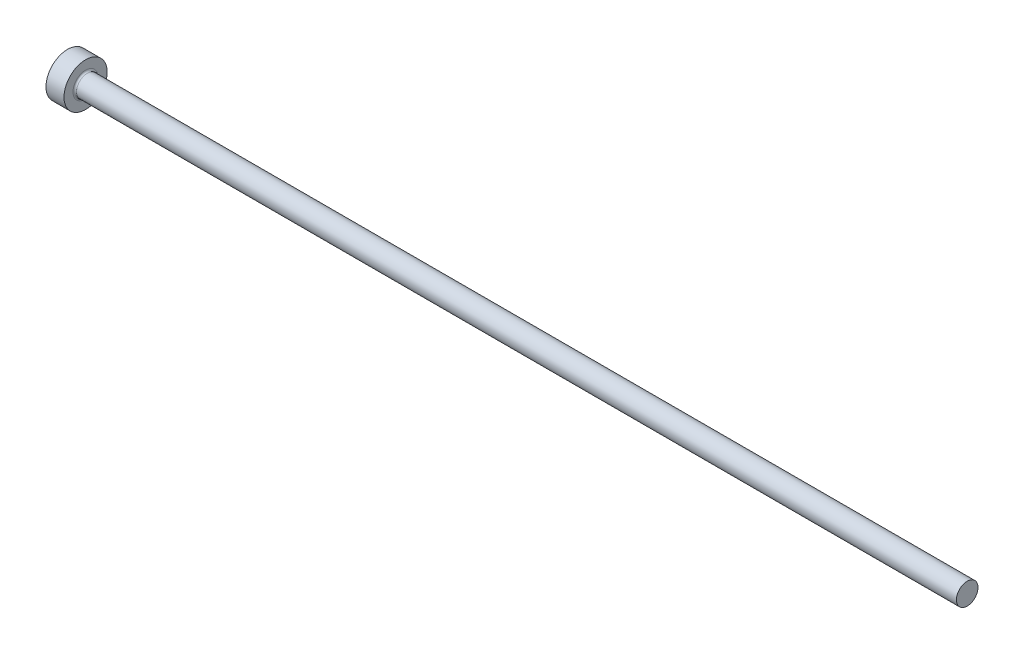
ISO-10303-21;
HEADER;
FILE_DESCRIPTION(('STEP AP214'),'2;1');
FILE_NAME('part.step','',(''),(''),'','','');
FILE_SCHEMA(('AUTOMOTIVE_DESIGN { 1 0 10303 214 1 1 1 1 }'));
ENDSEC;
DATA;
#1=APPLICATION_CONTEXT('core data for automotive mechanical design processes');
#2=APPLICATION_PROTOCOL_DEFINITION('international standard','automotive_design',2000,#1);
#3=PRODUCT_CONTEXT('',#1,'mechanical');
#4=PRODUCT('Part','Part','',(#3));
#5=PRODUCT_RELATED_PRODUCT_CATEGORY('part','',(#4));
#6=PRODUCT_DEFINITION_FORMATION('','',#4);
#7=PRODUCT_DEFINITION_CONTEXT('part definition',#1,'design');
#8=PRODUCT_DEFINITION('design','',#6,#7);
#9=PRODUCT_DEFINITION_SHAPE('','',#8);
#10=(LENGTH_UNIT() NAMED_UNIT(*) SI_UNIT(.MILLI.,.METRE.));
#11=(NAMED_UNIT(*) PLANE_ANGLE_UNIT() SI_UNIT($,.RADIAN.));
#12=(NAMED_UNIT(*) SI_UNIT($,.STERADIAN.) SOLID_ANGLE_UNIT());
#13=UNCERTAINTY_MEASURE_WITH_UNIT(LENGTH_MEASURE(1.E-05),#10,'distance_accuracy_value','');
#14=(GEOMETRIC_REPRESENTATION_CONTEXT(3) GLOBAL_UNCERTAINTY_ASSIGNED_CONTEXT((#13)) GLOBAL_UNIT_ASSIGNED_CONTEXT((#10,
#11,#12)) REPRESENTATION_CONTEXT('',''));
#15=CARTESIAN_POINT('',(0.,0.,0.));
#16=DIRECTION('',(0.,0.,1.));
#17=DIRECTION('',(1.,0.,0.));
#18=AXIS2_PLACEMENT_3D('',#15,#16,#17);
#19=CARTESIAN_POINT('',(0.,0.,0.));
#20=DIRECTION('',(-1.,0.,0.));
#21=DIRECTION('',(0.,-1.,0.));
#22=AXIS2_PLACEMENT_3D('',#19,#20,#21);
#23=PLANE('',#22);
#24=CARTESIAN_POINT('',(0.,0.,0.));
#25=DIRECTION('',(1.,0.,0.));
#26=DIRECTION('',(0.,1.,0.));
#27=AXIS2_PLACEMENT_3D('',#24,#25,#26);
#28=CIRCLE('',#27,6.);
#29=CARTESIAN_POINT('',(0.,6.,0.));
#30=VERTEX_POINT('',#29);
#31=EDGE_CURVE('E25',#30,#30,#28,.T.);
#32=ORIENTED_EDGE('',*,*,#31,.F.);
#33=EDGE_LOOP('',(#32));
#34=FACE_BOUND('',#33,.T.);
#35=ADVANCED_FACE('F14',(#34),#23,.T.);
#36=CARTESIAN_POINT('',(250.,0.,0.));
#37=DIRECTION('',(1.,0.,0.));
#38=DIRECTION('',(0.,1.,0.));
#39=AXIS2_PLACEMENT_3D('',#36,#37,#38);
#40=CYLINDRICAL_SURFACE('',#39,6.);
#41=ORIENTED_EDGE('',*,*,#31,.T.);
#42=EDGE_LOOP('',(#41));
#43=FACE_BOUND('',#42,.T.);
#44=CARTESIAN_POINT('',(5.,0.,0.));
#45=DIRECTION('',(1.,0.,0.));
#46=DIRECTION('',(0.,1.,0.));
#47=AXIS2_PLACEMENT_3D('',#44,#45,#46);
#48=CIRCLE('',#47,6.);
#49=CARTESIAN_POINT('',(5.,6.,0.));
#50=VERTEX_POINT('',#49);
#51=EDGE_CURVE('E29',#50,#50,#48,.T.);
#52=ORIENTED_EDGE('',*,*,#51,.F.);
#53=EDGE_LOOP('',(#52));
#54=FACE_BOUND('',#53,.T.);
#55=ADVANCED_FACE('F51',(#43,#54),#40,.T.);
#56=CARTESIAN_POINT('',(5.,6.,0.));
#57=DIRECTION('',(1.,0.,0.));
#58=DIRECTION('',(0.,1.,0.));
#59=AXIS2_PLACEMENT_3D('',#56,#57,#58);
#60=PLANE('',#59);
#61=CARTESIAN_POINT('',(5.,0.,0.));
#62=DIRECTION('',(1.,0.,0.));
#63=DIRECTION('',(0.,1.,0.));
#64=AXIS2_PLACEMENT_3D('',#61,#62,#63);
#65=CIRCLE('',#64,3.49999999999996);
#66=CARTESIAN_POINT('',(5.,3.49999999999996,0.));
#67=VERTEX_POINT('',#66);
#68=EDGE_CURVE('E9',#67,#67,#65,.F.);
#69=ORIENTED_EDGE('',*,*,#68,.T.);
#70=EDGE_LOOP('',(#69));
#71=FACE_BOUND('',#70,.T.);
#72=ORIENTED_EDGE('',*,*,#51,.T.);
#73=EDGE_LOOP('',(#72));
#74=FACE_BOUND('',#73,.T.);
#75=ADVANCED_FACE('F42',(#71,#74),#60,.T.);
#76=CARTESIAN_POINT('',(250.,0.,0.));
#77=DIRECTION('',(1.,0.,0.));
#78=DIRECTION('',(0.,1.,0.));
#79=AXIS2_PLACEMENT_3D('',#76,#77,#78);
#80=CYLINDRICAL_SURFACE('',#79,2.99999999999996);
#81=CARTESIAN_POINT('',(5.5,0.,0.));
#82=DIRECTION('',(1.,0.,0.));
#83=DIRECTION('',(0.,1.,0.));
#84=AXIS2_PLACEMENT_3D('',#81,#82,#83);
#85=CIRCLE('',#84,2.99999999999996);
#86=CARTESIAN_POINT('',(5.5,2.99999999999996,0.));
#87=VERTEX_POINT('',#86);
#88=EDGE_CURVE('E21',#87,#87,#85,.T.);
#89=ORIENTED_EDGE('',*,*,#88,.T.);
#90=EDGE_LOOP('',(#89));
#91=FACE_BOUND('',#90,.T.);
#92=CARTESIAN_POINT('',(250.,0.,0.));
#93=DIRECTION('',(1.,0.,0.));
#94=DIRECTION('',(0.,1.,0.));
#95=AXIS2_PLACEMENT_3D('',#92,#93,#94);
#96=CIRCLE('',#95,3.);
#97=CARTESIAN_POINT('',(250.,3.00000000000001,0.));
#98=VERTEX_POINT('',#97);
#99=EDGE_CURVE('E34',#98,#98,#96,.T.);
#100=ORIENTED_EDGE('',*,*,#99,.F.);
#101=EDGE_LOOP('',(#100));
#102=FACE_BOUND('',#101,.T.);
#103=ADVANCED_FACE('F40',(#91,#102),#80,.T.);
#104=CARTESIAN_POINT('',(250.,3.,0.));
#105=DIRECTION('',(1.,0.,0.));
#106=DIRECTION('',(0.,1.,0.));
#107=AXIS2_PLACEMENT_3D('',#104,#105,#106);
#108=PLANE('',#107);
#109=ORIENTED_EDGE('',*,*,#99,.T.);
#110=EDGE_LOOP('',(#109));
#111=FACE_BOUND('',#110,.T.);
#112=ADVANCED_FACE('F38',(#111),#108,.T.);
#113=CARTESIAN_POINT('',(5.5,0.,0.));
#114=DIRECTION('',(1.,0.,0.));
#115=DIRECTION('',(0.,1.,0.));
#116=AXIS2_PLACEMENT_3D('',#113,#114,#115);
#117=TOROIDAL_SURFACE('',#116,3.49999999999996,0.5);
#118=ORIENTED_EDGE('',*,*,#68,.F.);
#119=EDGE_LOOP('',(#118));
#120=FACE_BOUND('',#119,.T.);
#121=ORIENTED_EDGE('',*,*,#88,.F.);
#122=EDGE_LOOP('',(#121));
#123=FACE_BOUND('',#122,.T.);
#124=ADVANCED_FACE('F16',(#120,#123),#117,.F.);
#125=CLOSED_SHELL('',(#35,#55,#75,#103,#112,#124));
#126=MANIFOLD_SOLID_BREP('B1',#125);
#127=ADVANCED_BREP_SHAPE_REPRESENTATION('',(#18,#126),#14);
#128=SHAPE_DEFINITION_REPRESENTATION(#9,#127);
ENDSEC;
END-ISO-10303-21;
